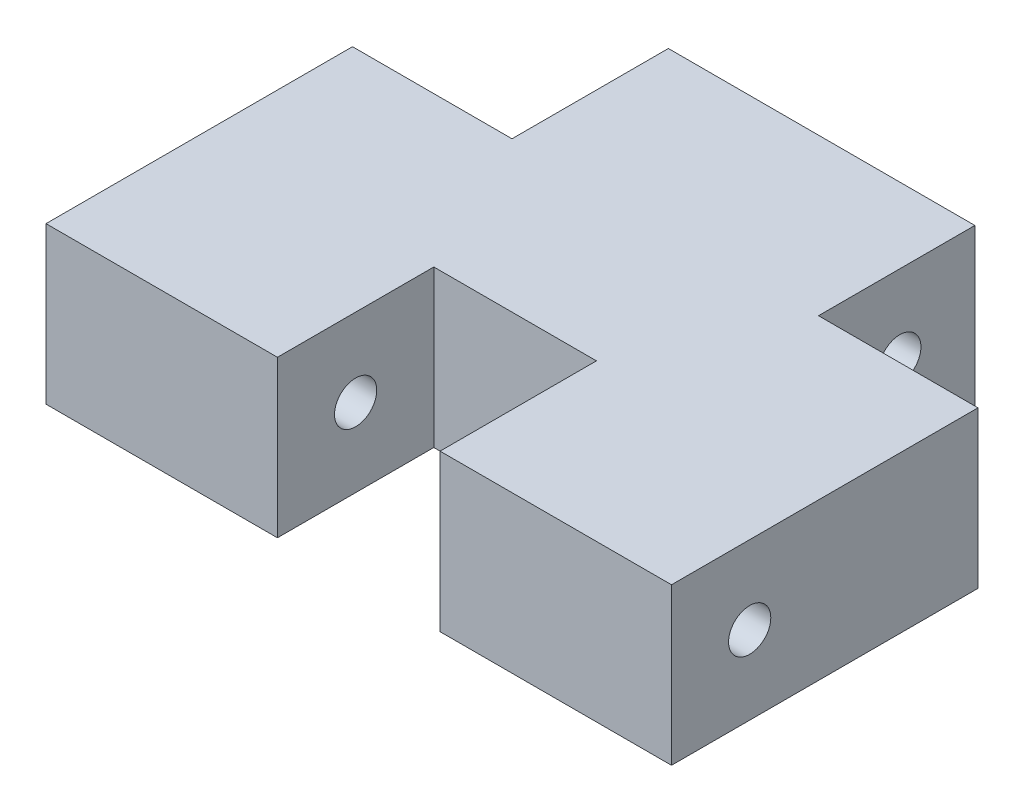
from build123d import *

# Parameters (mm, degrees)
FINGERBASE_DEPTH    = 6.35
PINHOLES_DEPTH      = 30.044153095
PINHOLES_DEPTH_BACK = 30.044153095
SKETCH2_R           = 0.85725


with BuildPart() as part:
    # Sketch1 → FingerBase (new body)
    with BuildSketch(Plane(origin=(0, 0, 0), x_dir=(1, 0, 0), z_dir=(0, 1, 0))):
        Polygon((-6.223, 6.223), (6.223, 6.223), (6.223, -0.127), (12.7, -0.127), (12.7, -12.573), (3.302, -12.573), (3.302, -6.223), (-3.302, -6.223), (-3.302, -12.573), (-12.7, -12.573), (-12.7, -0.127), (-6.223, -0.127), align=None)
    extrude(amount=FINGERBASE_DEPTH)

    # Sketch2 → PinHoles (cut, two sides: drawn at the far end of the back side and taken through both)
    with BuildSketch(Plane(origin=(12.7, 0, 0), x_dir=(0, 0, -1), z_dir=(1, 0, 0)).offset(-PINHOLES_DEPTH_BACK)):
        with Locations((-9.398, 3.175)):
            Circle(SKETCH2_R)
        with Locations((3.175, 3.175)):
            Circle(SKETCH2_R)
    extrude(amount=PINHOLES_DEPTH + PINHOLES_DEPTH_BACK, mode=Mode.SUBTRACT)


solid = part.part
